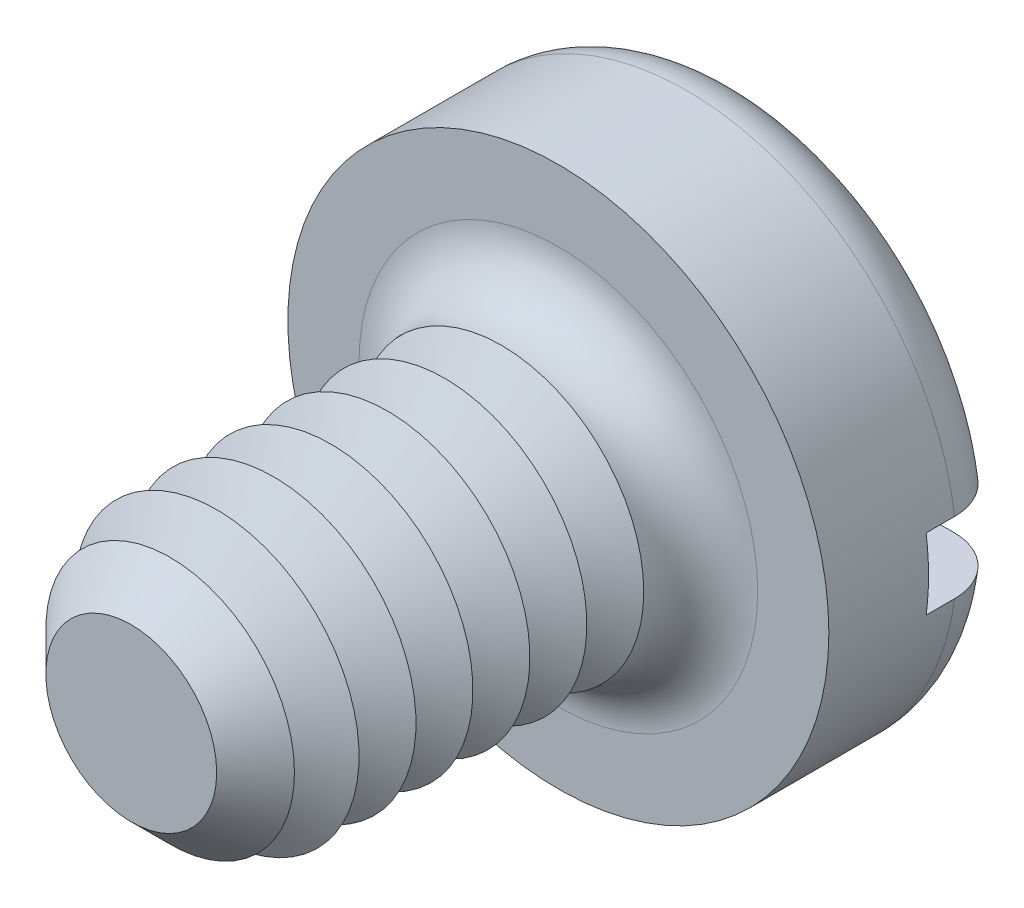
from build123d import *

# Parameters (mm, degrees)
SKETCH3_R           = 1.9
BOSS_EXTRUDE2_DEPTH = 1.3
SKETCH4_R           = 1
BOSS_EXTRUDE3_DEPTH = 3
FILLET1_R           = 0.4
CHAMFER1_SIZE       = 0.4
LPATTERN1_COUNT     = 6
LPATTERN1_PITCH     = 0.4
SKETCH8_W           = 3.8
SKETCH8_H           = 0.5
CUT_EXTRUDE1_DEPTH  = 0.6


with BuildPart() as part:
    # Sketch3 → Boss-Extrude2 (new body)
    with BuildSketch(Plane.XY):
        Circle(SKETCH3_R)
    extrude(amount=-BOSS_EXTRUDE2_DEPTH)

    # Sketch4 → Boss-Extrude3 (add)
    with BuildSketch(Plane.XY):
        Circle(SKETCH4_R)
    extrude(amount=BOSS_EXTRUDE3_DEPTH)

    # Fillet1
    fillet1_edges = [part.edges().sort_by_distance(p)[0] for p in [
        (-1.9, 0, -1.3),
        (-1, 0, 0),
    ]]
    fillet(fillet1_edges, radius=FILLET1_R)

    # Chamfer1
    chamfer1_edges = [part.edges().sort_by_distance(p)[0] for p in [
        (-1, 0, 3),
    ]]
    chamfer(chamfer1_edges, length=CHAMFER1_SIZE)

    # Sketch6 → Cut-Revolve1 (revolve, cut)
    with BuildSketch(Plane(origin=(0, 0, 0), x_dir=(0, 0, -1), z_dir=(1, 0, 0)), mode=Mode.PRIVATE) as cut_revolve1_sk:
        Polygon((-0.4, 1), (-0.6, 0.653589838), (-0.8, 1), align=None)
    cut_revolve1 = revolve(cut_revolve1_sk.sketch.rotate(Axis((0, 0, -1.694361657), (0, 0, 1)), 90), axis=Axis((0, 0, -1.694361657), (0, 0, 1)), mode=Mode.SUBTRACT)

    # LPattern1: Cut-Revolve1 ×6
    with Locations(*[(0, 0, i * LPATTERN1_PITCH) for i in range(1, LPATTERN1_COUNT)]):
        add(cut_revolve1, mode=Mode.SUBTRACT)

    # Sketch8 → Cut-Extrude1 (cut)
    with BuildSketch(Plane(origin=(0, 0, -1.3), x_dir=(-1, 0, 0), z_dir=(0, 0, -1))):
        Rectangle(SKETCH8_W, SKETCH8_H)
    extrude(amount=-CUT_EXTRUDE1_DEPTH, mode=Mode.SUBTRACT)


solid = part.part
